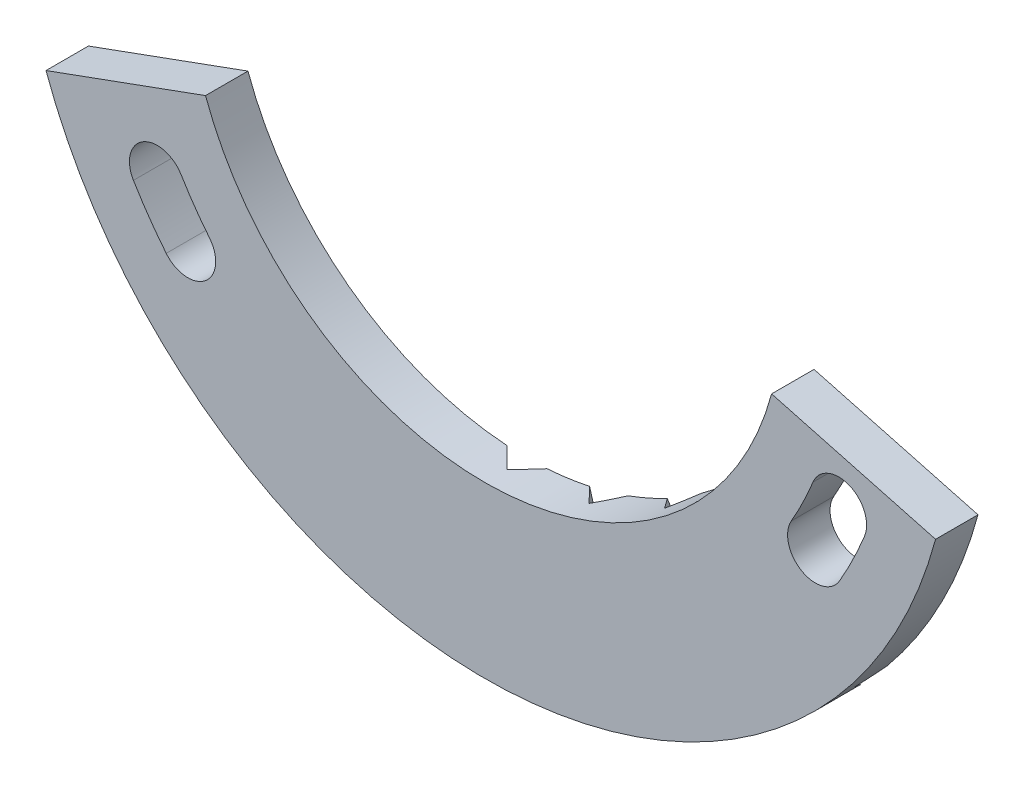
from build123d import *

# Parameters (mm, degrees)
BOSS_EXTRUDE1_DEPTH = 3.175
CUT_EXTRUDE1_DEPTH  = 12.7
CIRPATTERN1_COUNT   = 4
CIRPATTERN1_ANGLE   = 48
CUT_EXTRUDE2_DEPTH  = 41.853468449


with BuildPart() as part:
    # Sketch1 → Boss-Extrude1 (new body)
    with BuildSketch(Plane.XY):
        with BuildLine():
            Line((-20.884668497, 20.973602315), (-32.818764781, 16.629946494))
            ThreePointArc((-32.818764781, 16.629946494), (1.523407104, -6.316759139), (33.734959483, 19.53574485))
            Line((33.734959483, 19.53574485), (21.467701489, 22.822746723))
            ThreePointArc((21.467701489, 22.822746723), (0.969440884, 6.371153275), (-20.884668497, 20.973602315))
        make_face()
    extrude(amount=BOSS_EXTRUDE1_DEPTH)

    # Sketch3 → Cut-Extrude1 (cut, symmetric)
    with BuildSketch(Plane(origin=(0, 0, 0), x_dir=(1, 0, 0), z_dir=(0, 1, 0))):
        Polygon((-3.780346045, 2.286), (0, -1.494346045), (3.780346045, 2.286), align=None)
    cut_extrude1 = extrude(amount=CUT_EXTRUDE1_DEPTH, both=True, mode=Mode.SUBTRACT)

    # CirPattern1: Cut-Extrude1 ×4 about axis
    cirpattern1_axis = Axis((0, 28.575, 0), (0, 0, 1))
    for i in range(1, CIRPATTERN1_COUNT):
        add(cut_extrude1.rotate(cirpattern1_axis, i * CIRPATTERN1_ANGLE / (CIRPATTERN1_COUNT - 1)), mode=Mode.SUBTRACT)

    # Sketch4 → Cut-Extrude2 (cut, through all)
    with BuildSketch(Plane.XY.offset(3.175)):
        with BuildLine():
            ThreePointArc((-23.825585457, 9.281421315), (-20.896197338, 8.973530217), (-20.58830624, 11.902918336))
            ThreePointArc((-20.58830624, 11.902918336), (-21.701139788, 13.379698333), (-22.708247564, 14.930508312))
            ThreePointArc((-22.708247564, 14.930508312), (-25.56627692, 15.643095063), (-26.278863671, 12.785065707))
            ThreePointArc((-26.278863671, 12.785065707), (-25.113399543, 10.99040833), (-23.825585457, 9.281421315))
        make_face()
        with BuildLine():
            ThreePointArc((22.942918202, 15.3289), (23.705275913, 12.483742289), (26.550433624, 13.2461))
            ThreePointArc((26.550433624, 13.2461), (27.555048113, 15.135505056), (28.425417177, 17.09038598))
            ThreePointArc((28.425417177, 17.09038598), (27.274509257, 19.801755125), (24.563140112, 18.650847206))
            ThreePointArc((24.563140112, 18.650847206), (23.811031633, 16.961583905), (22.942918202, 15.3289))
        make_face()
    extrude(amount=-CUT_EXTRUDE2_DEPTH, mode=Mode.SUBTRACT)


solid = part.part
